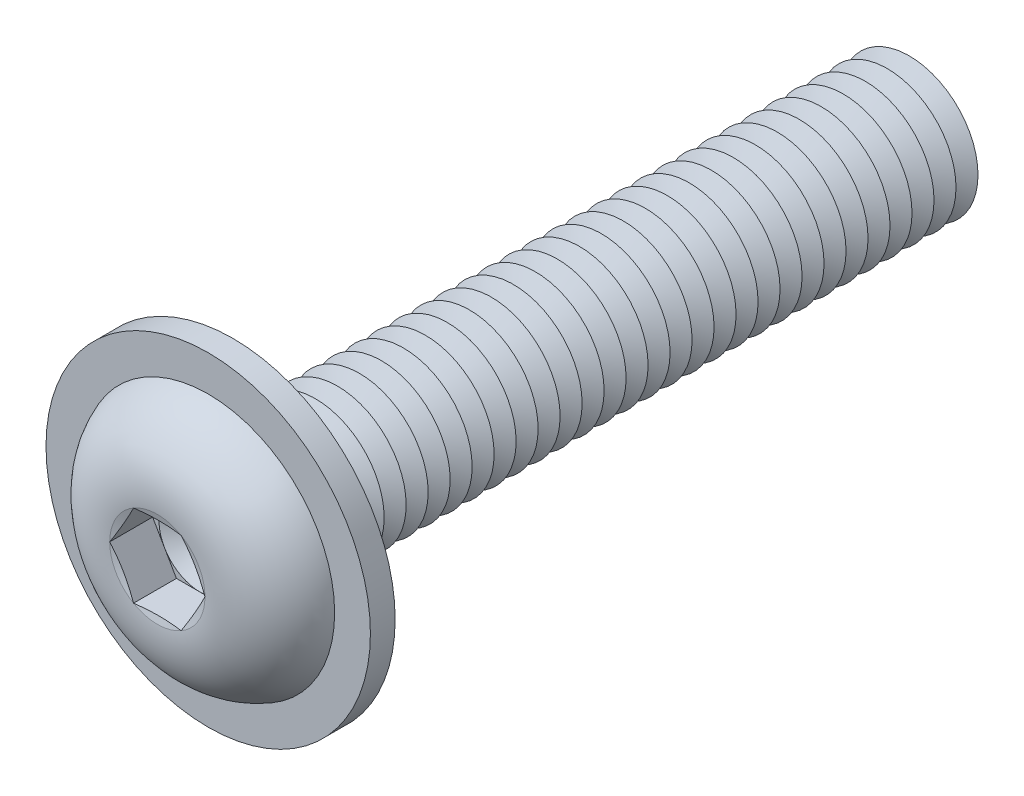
from build123d import *

# Parameters (mm, degrees)
FILLET1_R           = 0.4
LPATTERN1_COUNT     = 31
LPATTERN1_PITCH     = 0.8
CUT_EXTRUDE1_DEPTH  = 1.56
SKETCH5_R           = 5.9
SKETCH5_R_2         = 2.9
BOSS_EXTRUDE1_DEPTH = 0.9


with BuildPart() as part:
    # Sketch1 → Revolve1 (revolve)
    with BuildSketch(Plane(origin=(0, 0, 0), x_dir=(0, 0, -1), z_dir=(1, 0, 0)), mode=Mode.PRIVATE) as revolve1_sk:
        with BuildLine():
            Line((0, 2.5), (0, 4.75))
            ThreePointArc((0, 4.75), (-2.041477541, 3.848329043), (-2.75, 1.73205))
            Line((-2.75, 1.73205), (-2.517949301, 0.866025))
            Line((-2.517949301, 0.866025), (-2.75, 0.866025))
            Line((-2.75, 0.866025), (-2.75, 0))
            Line((-2.75, 0), (25, 0))
            Line((25, 0), (25, 2.5))
            Line((25, 2.5), (0, 2.5))
        make_face()
    revolve(revolve1_sk.sketch.rotate(Axis((0, 0, -25), (0, 0, 1)), 90), axis=Axis((0, 0, -25), (0, 0, 1)))

    # Fillet1
    fillet1_edges = [part.edges().sort_by_distance(p)[0] for p in [
        (2.5, 0, 0),
    ]]
    fillet(fillet1_edges, radius=FILLET1_R)

    # Sketch2 → Cut-Revolve1 (revolve, cut)
    with BuildSketch(Plane(origin=(0, 0, 0), x_dir=(0, 0, -1), z_dir=(1, 0, 0)), mode=Mode.PRIVATE) as cut_revolve1_sk:
        Polygon((24.6, 2.5), (25.4, 2.5), (25, 1.807179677), align=None)
    cut_revolve1 = revolve(cut_revolve1_sk.sketch.rotate(Axis((0, 0, -25), (0, 0, -1)), 270), axis=Axis((0, 0, -25), (0, 0, -1)), mode=Mode.SUBTRACT)

    # LPattern1: Cut-Revolve1 ×31
    with Locations(*[(0, 0, i * LPATTERN1_PITCH) for i in range(1, LPATTERN1_COUNT)]):
        add(cut_revolve1, mode=Mode.SUBTRACT)

    # Sketch3 → Cut-Extrude1 (cut)
    with BuildSketch(Plane.XY.offset(2.75)):
        Polygon((0.866025, 1.499999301), (-0.866025, 1.499999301), (-1.73205, 0), (-0.866025, -1.499999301), (0.866025, -1.499999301), (1.73205, 0), align=None)
    extrude(amount=-CUT_EXTRUDE1_DEPTH, mode=Mode.SUBTRACT)

    # Cut-Extrude2 cone 1 section (on through the dimple's axis) → Cut-Extrude2 (revolve, cut)
    with BuildSketch(Plane(origin=(0, 0, 1.19), x_dir=(0, -1, 0), z_dir=(1, 0, 0))):
        Polygon((0, 0), (1.499999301, 0), (0, 0.866025), align=None)
    revolve(axis=Axis((0, 0, 1.19), (0, 0, -1)), mode=Mode.SUBTRACT)

    # Sketch5 → Boss-Extrude1 (add)
    with BuildSketch(Plane(origin=(0, 0, 0), x_dir=(-1, 0, 0), z_dir=(0, 0, -1))):
        with Locations(Location((0, 0, 0), (0, 0, 90))):
            Circle(SKETCH5_R)
        Circle(SKETCH5_R_2, mode=Mode.SUBTRACT)
    extrude(amount=-BOSS_EXTRUDE1_DEPTH)


solid = part.part
